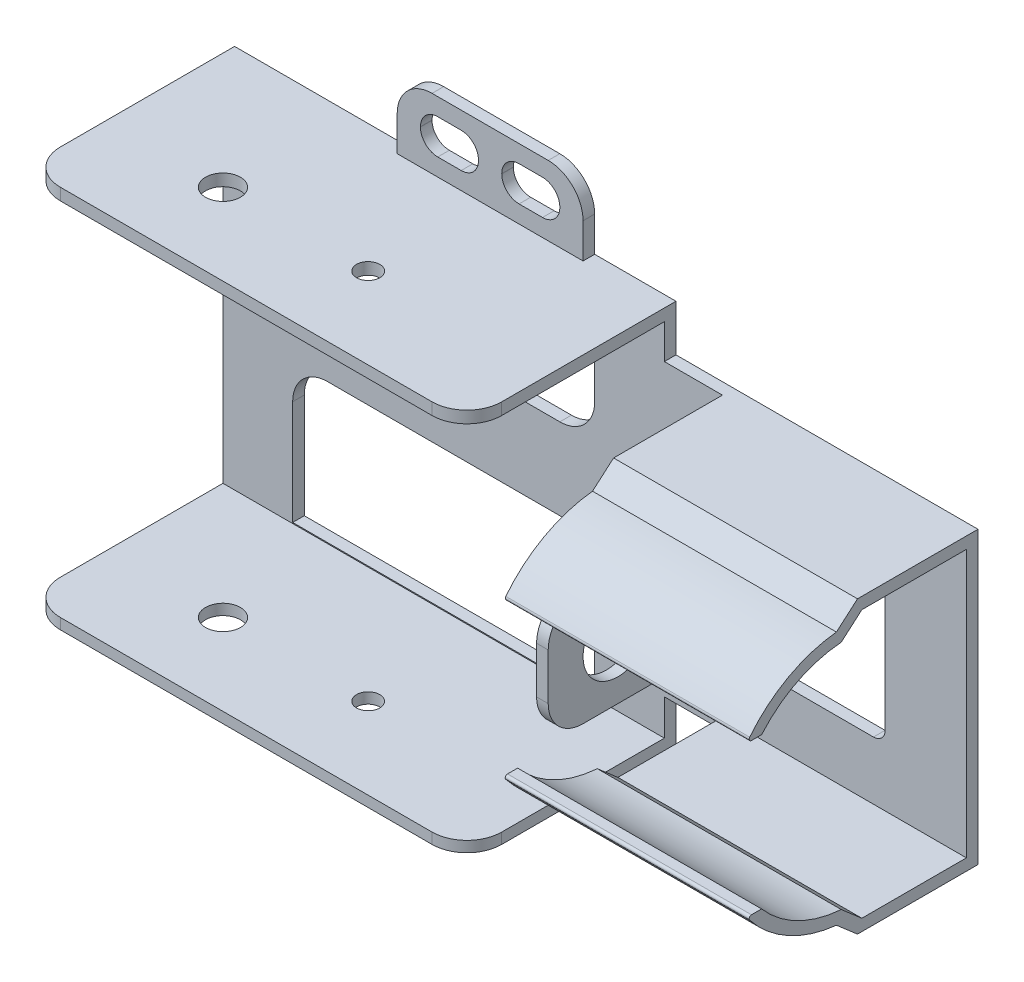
from build123d import *

# Parameters (mm, degrees)
EXTRUSION1_DEPTH           = 1
ESQUISSE3_W                = 13
ESQUISSE3_H                = 12.991306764
ESQUISSE3_W_2              = 26
ESQUISSE3_H_2              = 12
ENL_V_MAT_EXTRU_1_DEPTH    = 1
CONG_2_R                   = 3
ESQUISSE14_W               = 38
ESQUISSE14_H               = 1.021269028
ESQUISSE14_H_2             = 0.92452696
EXTRUSION2_DEPTH           = 17
CONG_3_R                   = 3
EXTRUSION3_DEPTH           = 21
ENL_V_MAT_EXTRU_2_DEPTH    = 30
ESQUISSE17_W               = 28.02241686
ESQUISSE17_H               = 12.991306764
ENL_V_MAT_EXTRU_3_DEPTH    = 30
CONG_4_R                   = 0.2
ESQUISSE18_W               = 1
ESQUISSE18_H               = 10
EXTRUSION4_DEPTH           = 16
CONG_5_R                   = 3
ESQUISSE19_R               = 3
ENL_V_MAT_EXTRU_4_DEPTH    = 16
CONG_6_R                   = 1
ESQUISSE20_R               = 1.551729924
ESQUISSE20_R_2             = 1.5
ESQUISSE20_R_3             = 1
ENL_V_MAT_EXTRU_7_DEPTH    = 46
ENL_V_MAT_EXTRU_9_DEPTH    = 77.863412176
R_P_TITION_LIN_AIRE1_COUNT = 2
R_P_TITION_LIN_AIRE1_PITCH = 39


with BuildPart() as part:
    # Esquisse1 → Extrusion1 (new body)
    with BuildSketch(Plane.XY):
        Polygon((-30.989172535, 6.739018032), (-30.989172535, 10.739018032), (-37.989172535, 10.739018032), (-37.989172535, 16.739018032), (-53.989172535, 16.739018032), (-53.989172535, 10.739018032), (-68.989172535, 10.739018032), (-68.989172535, -22.260981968), (-53.989172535, -22.260981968), (-53.989172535, -28.260981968), (-37.989172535, -28.260981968), (-37.989172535, -22.260981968), (-30.989172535, -22.260981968), (-30.989172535, -18.252288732), (-4.989172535, -18.252288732), (-4.989172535, 6.739018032), align=None)
    extrude(amount=EXTRUSION1_DEPTH)

    # Esquisse3 → Enl_v. mat.-Extru.1 (cut)
    with BuildSketch(Plane.XY.offset(1)):
        with Locations((-18.489172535, -5.75663535)):
            Rectangle(ESQUISSE3_W, ESQUISSE3_H)
        with Locations((-49.989172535, 3.747711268)):
            Rectangle(ESQUISSE3_W_2, ESQUISSE3_H_2)
        with Locations((-49.989172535, -15.252288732)):
            Rectangle(ESQUISSE3_W_2, ESQUISSE3_H_2)
    extrude(amount=-ENL_V_MAT_EXTRU_1_DEPTH, mode=Mode.SUBTRACT)

    # Cong_2
    cong_2_edges = [part.edges().sort_by_distance(p)[0] for p in [
        (-37.989172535, -28.260981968, 0.5),
        (-53.989172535, -28.260981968, 0.5),
        (-53.989172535, 16.739018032, 0.5),
        (-37.989172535, 16.739018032, 0.5),
        (-62.989172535, -2.252288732, 0.5),
        (-36.989172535, -2.252288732, 0.5),
        (-36.989172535, -9.252288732, 0.5),
        (-62.989172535, -9.252288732, 0.5),
    ]]
    fillet(cong_2_edges, radius=CONG_2_R)

    # Esquisse14 → Extrusion2 (add)
    with BuildSketch(Plane.XY.offset(1)):
        with Locations((-49.989172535, 10.228383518)):
            Rectangle(ESQUISSE14_W, ESQUISSE14_H)
        with Locations((-49.989172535, -21.798718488)):
            Rectangle(ESQUISSE14_W, ESQUISSE14_H_2)
    extrude(amount=EXTRUSION2_DEPTH)

    # Cong_3
    cong_3_edges = [part.edges().sort_by_distance(p)[0] for p in [
        (-68.989172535, 10.228383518, 18),
        (-30.989172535, 10.228383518, 18),
        (-68.989172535, -21.798718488, 18),
        (-30.989172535, -21.798718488, 18),
    ]]
    fillet(cong_3_edges, radius=CONG_3_R)

    # Esquisse15 → Extrusion3 (add)
    with BuildSketch(Plane(origin=(-4.989172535, 0, 0), x_dir=(0, 0, -1), z_dir=(1, 0, 0))):
        with BuildLine():
            Line((-1, -18.252288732), (-1, 6.739018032))
            Line((-1, 6.739018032), (-10.37254476, 6.739018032))
            Line((-10.37254476, 6.739018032), (-12.186988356, 5.16922405))
            ThreePointArc((-12.186988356, 5.16922405), (-22.028015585, -5.760981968), (-12.186988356, -16.691187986))
            Line((-12.186988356, -16.691187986), (-10.37254476, -18.260981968))
            Line((-10.37254476, -18.260981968), (0, -18.260981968))
            Line((0, -18.260981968), (0, -18.252288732))
            Line((0, -18.252288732), (-1, -18.252288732))
        make_face()
    extrude(amount=-EXTRUSION3_DEPTH)

    # Esquisse16 → Enl_v. mat.-Extru.2 (cut)
    with BuildSketch(Plane(origin=(-4.989172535, 0, 0), x_dir=(0, 0, -1), z_dir=(1, 0, 0))):
        with BuildLine():
            Line((-1, -17.260981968), (-1, 5.739018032))
            Line((-1, 5.739018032), (-10, 5.739018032))
            Line((-10, 5.739018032), (-11.776399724, 4.202138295))
            ThreePointArc((-11.776399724, 4.202138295), (-21.028015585, -5.760981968), (-11.776399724, -15.724102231))
            Line((-11.776399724, -15.724102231), (-10, -17.260981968))
            Line((-10, -17.260981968), (-1, -17.260981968))
        make_face()
    extrude(amount=-ENL_V_MAT_EXTRU_2_DEPTH, mode=Mode.SUBTRACT)

    # Esquisse17 → Enl_v. mat.-Extru.3 (cut)
    with BuildSketch(Plane.XY.offset(1)):
        with Locations((-15.08239714, -5.75663535)):
            Rectangle(ESQUISSE17_W, ESQUISSE17_H)
    extrude(amount=ENL_V_MAT_EXTRU_3_DEPTH, mode=Mode.SUBTRACT)

    # Cong_4
    cong_4_edges = [part.edges().sort_by_distance(p)[0] for p in [
        (-15.489172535, -12.252288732, 19.90622128),
        (-15.489172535, 0.739018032, 19.899851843),
    ]]
    fillet(cong_4_edges, radius=CONG_4_R)

    # Esquisse18 → Extrusion4 (add)
    with BuildSketch(Plane.XY.offset(1)):
        with Locations((-25.489172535, -5.760981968)):
            Rectangle(ESQUISSE18_W, ESQUISSE18_H)
    extrude(amount=EXTRUSION4_DEPTH)

    # Cong_5
    cong_5_edges = [part.edges().sort_by_distance(p)[0] for p in [
        (-25.489172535, -0.760981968, 17),
        (-25.489172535, -10.760981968, 17),
    ]]
    fillet(cong_5_edges, radius=CONG_5_R)

    # Esquisse19 → Enl_v. mat.-Extru.4 (cut)
    with BuildSketch(Plane.ZY.offset(25.989172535)):
        with Locations((11, -5.760981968)):
            Circle(ESQUISSE19_R)
    extrude(amount=-ENL_V_MAT_EXTRU_4_DEPTH, mode=Mode.SUBTRACT)

    # Cong_6
    cong_6_edges = [part.edges().sort_by_distance(p)[0] for p in [
        (-24.989172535, -12.252288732, 0.5),
        (-24.989172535, 0.739018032, 0.5),
        (-11.989172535, 0.739018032, 0.5),
        (-11.989172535, -12.252288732, 0.5),
    ]]
    fillet(cong_6_edges, radius=CONG_6_R)

    # Esquisse20 → Enl_v. mat.-Extru.7 (cut)
    with BuildSketch(Plane(origin=(0, 10.739018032, 0), x_dir=(-1, 0, 0), z_dir=(0, 1, 0))):
        with Locations((109.664285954, 11.585691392)):
            Circle(ESQUISSE20_R)
        with Locations(Location((58.989172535, 11, 0), (0, 0, 90))):
            Circle(ESQUISSE20_R_2)
        with Locations(Location((46.489172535, 11, 0), (0, 0, 90))):
            Circle(ESQUISSE20_R_3)
    extrude(amount=-ENL_V_MAT_EXTRU_7_DEPTH, mode=Mode.SUBTRACT)

    # Esquisse22 → Enl_v. mat.-Extru.9 (cut, through all)
    with BuildSketch(Plane.XY.offset(1)):
        with BuildLine():
            Line((-50.499172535, -23.760981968), (-48.479172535, -23.760981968))
            ThreePointArc((-48.479172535, -23.760981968), (-47.425583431, -24.197392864), (-46.989172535, -25.250981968))
            Line((-46.989172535, -25.250981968), (-46.989172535, -25.270981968))
            ThreePointArc((-46.989172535, -25.270981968), (-47.425583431, -26.324571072), (-48.479172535, -26.760981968))
            Line((-48.479172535, -26.760981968), (-50.499172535, -26.760981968))
            ThreePointArc((-50.499172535, -26.760981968), (-51.552761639, -26.324571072), (-51.989172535, -25.270981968))
            Line((-51.989172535, -25.270981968), (-51.989172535, -25.250981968))
            ThreePointArc((-51.989172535, -25.250981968), (-51.552761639, -24.197392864), (-50.499172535, -23.760981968))
        make_face()
        with BuildLine():
            Line((-43.499172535, -23.760981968), (-41.479172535, -23.760981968))
            ThreePointArc((-41.479172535, -23.760981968), (-40.425583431, -24.197392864), (-39.989172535, -25.250981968))
            Line((-39.989172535, -25.250981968), (-39.989172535, -25.270981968))
            ThreePointArc((-39.989172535, -25.270981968), (-40.425583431, -26.324571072), (-41.479172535, -26.760981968))
            Line((-41.479172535, -26.760981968), (-43.499172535, -26.760981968))
            ThreePointArc((-43.499172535, -26.760981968), (-44.552761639, -26.324571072), (-44.989172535, -25.270981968))
            Line((-44.989172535, -25.270981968), (-44.989172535, -25.250981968))
            ThreePointArc((-44.989172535, -25.250981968), (-44.552761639, -24.197392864), (-43.499172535, -23.760981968))
        make_face()
    enl_v_mat_extru_9 = extrude(amount=-ENL_V_MAT_EXTRU_9_DEPTH, mode=Mode.SUBTRACT)

    # R_p_tition lin_aire1: Enl_v. mat.-Extru.9 ×2
    with Locations(*[(0, i * R_P_TITION_LIN_AIRE1_PITCH, 0) for i in range(1, R_P_TITION_LIN_AIRE1_COUNT)]):
        add(enl_v_mat_extru_9, mode=Mode.SUBTRACT)


solid = part.part
